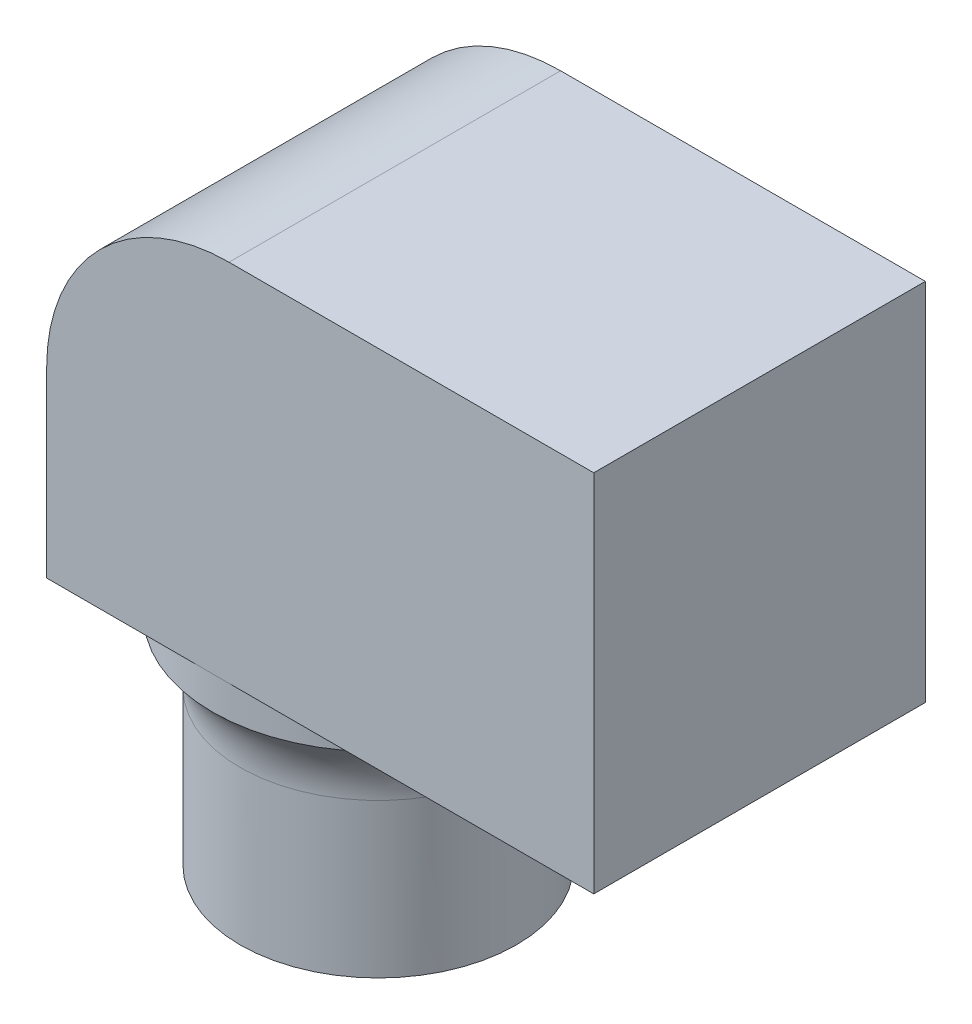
ISO-10303-21;
HEADER;
FILE_DESCRIPTION(('STEP AP214'),'2;1');
FILE_NAME('part.step','',(''),(''),'','','');
FILE_SCHEMA(('AUTOMOTIVE_DESIGN { 1 0 10303 214 1 1 1 1 }'));
ENDSEC;
DATA;
#1=APPLICATION_CONTEXT('core data for automotive mechanical design processes');
#2=APPLICATION_PROTOCOL_DEFINITION('international standard','automotive_design',2000,#1);
#3=PRODUCT_CONTEXT('',#1,'mechanical');
#4=PRODUCT('Part','Part','',(#3));
#5=PRODUCT_RELATED_PRODUCT_CATEGORY('part','',(#4));
#6=PRODUCT_DEFINITION_FORMATION('','',#4);
#7=PRODUCT_DEFINITION_CONTEXT('part definition',#1,'design');
#8=PRODUCT_DEFINITION('design','',#6,#7);
#9=PRODUCT_DEFINITION_SHAPE('','',#8);
#10=(LENGTH_UNIT() NAMED_UNIT(*) SI_UNIT(.MILLI.,.METRE.));
#11=(NAMED_UNIT(*) PLANE_ANGLE_UNIT() SI_UNIT($,.RADIAN.));
#12=(NAMED_UNIT(*) SI_UNIT($,.STERADIAN.) SOLID_ANGLE_UNIT());
#13=UNCERTAINTY_MEASURE_WITH_UNIT(LENGTH_MEASURE(1.E-05),#10,'distance_accuracy_value','');
#14=(GEOMETRIC_REPRESENTATION_CONTEXT(3) GLOBAL_UNCERTAINTY_ASSIGNED_CONTEXT((#13)) GLOBAL_UNIT_ASSIGNED_CONTEXT((#10,
#11,#12)) REPRESENTATION_CONTEXT('',''));
#15=CARTESIAN_POINT('',(0.,0.,0.));
#16=DIRECTION('',(0.,0.,1.));
#17=DIRECTION('',(1.,0.,0.));
#18=AXIS2_PLACEMENT_3D('',#15,#16,#17);
#19=CARTESIAN_POINT('',(16.5,-11.,20.));
#20=DIRECTION('',(0.,1.,0.));
#21=DIRECTION('',(-1.,0.,0.));
#22=AXIS2_PLACEMENT_3D('',#19,#20,#21);
#23=PLANE('',#22);
#24=CARTESIAN_POINT('',(-6.5,-11.,10.));
#25=DIRECTION('',(0.,-1.,0.));
#26=DIRECTION('',(1.,0.,0.));
#27=AXIS2_PLACEMENT_3D('',#24,#25,#26);
#28=CIRCLE('',#27,10.);
#29=CARTESIAN_POINT('',(-6.5,-11.,20.));
#30=VERTEX_POINT('',#29);
#31=CARTESIAN_POINT('',(-16.5,-11.,10.));
#32=VERTEX_POINT('',#31);
#33=EDGE_CURVE('E89',#30,#32,#28,.T.);
#34=ORIENTED_EDGE('',*,*,#33,.F.);
#35=DIRECTION('',(1.,0.,0.));
#36=VECTOR('',#35,1.);
#37=CARTESIAN_POINT('',(16.5,-11.,20.));
#38=LINE('',#37,#36);
#39=CARTESIAN_POINT('',(-16.5,-11.,20.));
#40=VERTEX_POINT('',#39);
#41=EDGE_CURVE('E71',#40,#30,#38,.T.);
#42=ORIENTED_EDGE('',*,*,#41,.F.);
#43=DIRECTION('',(0.,0.,-1.));
#44=VECTOR('',#43,1.);
#45=CARTESIAN_POINT('',(-16.5,-11.,20.));
#46=LINE('',#45,#44);
#47=EDGE_CURVE('E90',#40,#32,#46,.T.);
#48=ORIENTED_EDGE('',*,*,#47,.T.);
#49=EDGE_LOOP('',(#34,#42,#48));
#50=FACE_BOUND('',#49,.T.);
#51=ADVANCED_FACE('F15',(#50),#23,.F.);
#52=CARTESIAN_POINT('',(-6.5,-11.,0.));
#53=VERTEX_POINT('',#52);
#54=EDGE_CURVE('E23',#32,#53,#28,.T.);
#55=ORIENTED_EDGE('',*,*,#54,.F.);
#56=CARTESIAN_POINT('',(-16.5,-11.,0.));
#57=VERTEX_POINT('',#56);
#58=EDGE_CURVE('E120',#32,#57,#46,.T.);
#59=ORIENTED_EDGE('',*,*,#58,.T.);
#60=DIRECTION('',(1.,0.,0.));
#61=VECTOR('',#60,1.);
#62=CARTESIAN_POINT('',(16.5,-11.,0.));
#63=LINE('',#62,#61);
#64=EDGE_CURVE('E111',#57,#53,#63,.T.);
#65=ORIENTED_EDGE('',*,*,#64,.T.);
#66=EDGE_LOOP('',(#55,#59,#65));
#67=FACE_BOUND('',#66,.T.);
#68=ADVANCED_FACE('F144',(#67),#23,.F.);
#69=CARTESIAN_POINT('',(-16.5,-11.,20.));
#70=DIRECTION('',(1.,0.,0.));
#71=DIRECTION('',(0.,0.,-1.));
#72=AXIS2_PLACEMENT_3D('',#69,#70,#71);
#73=PLANE('',#72);
#74=DIRECTION('',(0.,-1.,0.));
#75=VECTOR('',#74,1.);
#76=CARTESIAN_POINT('',(-16.5,-11.,20.));
#77=LINE('',#76,#75);
#78=CARTESIAN_POINT('',(-16.5,0.,20.));
#79=VERTEX_POINT('',#78);
#80=EDGE_CURVE('E77',#79,#40,#77,.T.);
#81=ORIENTED_EDGE('',*,*,#80,.F.);
#82=DIRECTION('',(0.,0.,-1.));
#83=VECTOR('',#82,1.);
#84=CARTESIAN_POINT('',(-16.5,0.,20.));
#85=LINE('',#84,#83);
#86=CARTESIAN_POINT('',(-16.5,0.,0.));
#87=VERTEX_POINT('',#86);
#88=EDGE_CURVE('E122',#79,#87,#85,.T.);
#89=ORIENTED_EDGE('',*,*,#88,.T.);
#90=DIRECTION('',(0.,-1.,0.));
#91=VECTOR('',#90,1.);
#92=CARTESIAN_POINT('',(-16.5,-11.,0.));
#93=LINE('',#92,#91);
#94=EDGE_CURVE('E107',#87,#57,#93,.T.);
#95=ORIENTED_EDGE('',*,*,#94,.T.);
#96=ORIENTED_EDGE('',*,*,#58,.F.);
#97=ORIENTED_EDGE('',*,*,#47,.F.);
#98=EDGE_LOOP('',(#81,#89,#95,#96,#97));
#99=FACE_BOUND('',#98,.T.);
#100=ADVANCED_FACE('F139',(#99),#73,.F.);
#101=EDGE_CURVE('E37',#53,#30,#28,.T.);
#102=ORIENTED_EDGE('',*,*,#101,.F.);
#103=CARTESIAN_POINT('',(16.5,-11.,0.));
#104=VERTEX_POINT('',#103);
#105=EDGE_CURVE('E110',#53,#104,#63,.T.);
#106=ORIENTED_EDGE('',*,*,#105,.T.);
#107=DIRECTION('',(0.,0.,-1.));
#108=VECTOR('',#107,1.);
#109=CARTESIAN_POINT('',(16.5,-11.,20.));
#110=LINE('',#109,#108);
#111=CARTESIAN_POINT('',(16.5,-11.,20.));
#112=VERTEX_POINT('',#111);
#113=EDGE_CURVE('E86',#112,#104,#110,.T.);
#114=ORIENTED_EDGE('',*,*,#113,.F.);
#115=EDGE_CURVE('E74',#30,#112,#38,.T.);
#116=ORIENTED_EDGE('',*,*,#115,.F.);
#117=EDGE_LOOP('',(#102,#106,#114,#116));
#118=FACE_BOUND('',#117,.T.);
#119=ADVANCED_FACE('F84',(#118),#23,.F.);
#120=CARTESIAN_POINT('',(16.5,-11.,20.));
#121=DIRECTION('',(-1.,0.,0.));
#122=DIRECTION('',(0.,0.,1.));
#123=AXIS2_PLACEMENT_3D('',#120,#121,#122);
#124=PLANE('',#123);
#125=DIRECTION('',(0.,1.,0.));
#126=VECTOR('',#125,1.);
#127=CARTESIAN_POINT('',(16.5,-11.,0.));
#128=LINE('',#127,#126);
#129=CARTESIAN_POINT('',(16.5,11.,0.));
#130=VERTEX_POINT('',#129);
#131=EDGE_CURVE('E113',#104,#130,#128,.T.);
#132=ORIENTED_EDGE('',*,*,#131,.T.);
#133=DIRECTION('',(0.,0.,-1.));
#134=VECTOR('',#133,1.);
#135=CARTESIAN_POINT('',(16.5,11.,20.));
#136=LINE('',#135,#134);
#137=CARTESIAN_POINT('',(16.5,11.,20.));
#138=VERTEX_POINT('',#137);
#139=EDGE_CURVE('E106',#138,#130,#136,.T.);
#140=ORIENTED_EDGE('',*,*,#139,.F.);
#141=DIRECTION('',(0.,1.,0.));
#142=VECTOR('',#141,1.);
#143=CARTESIAN_POINT('',(16.5,-11.,20.));
#144=LINE('',#143,#142);
#145=EDGE_CURVE('E82',#112,#138,#144,.T.);
#146=ORIENTED_EDGE('',*,*,#145,.F.);
#147=ORIENTED_EDGE('',*,*,#113,.T.);
#148=EDGE_LOOP('',(#132,#140,#146,#147));
#149=FACE_BOUND('',#148,.T.);
#150=ADVANCED_FACE('F156',(#149),#124,.F.);
#151=CARTESIAN_POINT('',(16.5,11.,20.));
#152=DIRECTION('',(0.,-1.,0.));
#153=DIRECTION('',(1.,0.,0.));
#154=AXIS2_PLACEMENT_3D('',#151,#152,#153);
#155=PLANE('',#154);
#156=DIRECTION('',(-1.,0.,0.));
#157=VECTOR('',#156,1.);
#158=CARTESIAN_POINT('',(16.5,11.,0.));
#159=LINE('',#158,#157);
#160=CARTESIAN_POINT('',(-5.5,11.,0.));
#161=VERTEX_POINT('',#160);
#162=EDGE_CURVE('E101',#130,#161,#159,.T.);
#163=ORIENTED_EDGE('',*,*,#162,.T.);
#164=DIRECTION('',(0.,0.,-1.));
#165=VECTOR('',#164,1.);
#166=CARTESIAN_POINT('',(-5.5,11.,20.));
#167=LINE('',#166,#165);
#168=CARTESIAN_POINT('',(-5.5,11.,20.));
#169=VERTEX_POINT('',#168);
#170=EDGE_CURVE('E97',#161,#169,#167,.F.);
#171=ORIENTED_EDGE('',*,*,#170,.T.);
#172=DIRECTION('',(-1.,0.,0.));
#173=VECTOR('',#172,1.);
#174=CARTESIAN_POINT('',(16.5,11.,20.));
#175=LINE('',#174,#173);
#176=EDGE_CURVE('E104',#138,#169,#175,.T.);
#177=ORIENTED_EDGE('',*,*,#176,.F.);
#178=ORIENTED_EDGE('',*,*,#139,.T.);
#179=EDGE_LOOP('',(#163,#171,#177,#178));
#180=FACE_BOUND('',#179,.T.);
#181=ADVANCED_FACE('F130',(#180),#155,.F.);
#182=CARTESIAN_POINT('',(0.,0.,20.));
#183=DIRECTION('',(0.,0.,1.));
#184=DIRECTION('',(1.,0.,0.));
#185=AXIS2_PLACEMENT_3D('',#182,#183,#184);
#186=PLANE('',#185);
#187=ORIENTED_EDGE('',*,*,#176,.T.);
#188=CARTESIAN_POINT('',(-5.5,0.,20.));
#189=DIRECTION('',(0.,0.,1.));
#190=DIRECTION('',(1.,0.,0.));
#191=AXIS2_PLACEMENT_3D('',#188,#189,#190);
#192=CIRCLE('',#191,11.);
#193=EDGE_CURVE('E96',#169,#79,#192,.T.);
#194=ORIENTED_EDGE('',*,*,#193,.T.);
#195=ORIENTED_EDGE('',*,*,#80,.T.);
#196=ORIENTED_EDGE('',*,*,#41,.T.);
#197=ORIENTED_EDGE('',*,*,#115,.T.);
#198=ORIENTED_EDGE('',*,*,#145,.T.);
#199=EDGE_LOOP('',(#187,#194,#195,#196,#197,#198));
#200=FACE_BOUND('',#199,.T.);
#201=ADVANCED_FACE('F73',(#200),#186,.T.);
#202=CARTESIAN_POINT('',(0.,0.,0.));
#203=DIRECTION('',(0.,0.,1.));
#204=DIRECTION('',(1.,0.,0.));
#205=AXIS2_PLACEMENT_3D('',#202,#203,#204);
#206=PLANE('',#205);
#207=ORIENTED_EDGE('',*,*,#94,.F.);
#208=CARTESIAN_POINT('',(-5.5,0.,0.));
#209=DIRECTION('',(0.,0.,1.));
#210=DIRECTION('',(1.,0.,0.));
#211=AXIS2_PLACEMENT_3D('',#208,#209,#210);
#212=CIRCLE('',#211,11.);
#213=EDGE_CURVE('E125',#87,#161,#212,.F.);
#214=ORIENTED_EDGE('',*,*,#213,.T.);
#215=ORIENTED_EDGE('',*,*,#162,.F.);
#216=ORIENTED_EDGE('',*,*,#131,.F.);
#217=ORIENTED_EDGE('',*,*,#105,.F.);
#218=ORIENTED_EDGE('',*,*,#64,.F.);
#219=EDGE_LOOP('',(#207,#214,#215,#216,#217,#218));
#220=FACE_BOUND('',#219,.T.);
#221=ADVANCED_FACE('F142',(#220),#206,.F.);
#222=CARTESIAN_POINT('',(-5.5,0.,20.));
#223=DIRECTION('',(0.,0.,-1.));
#224=DIRECTION('',(-1.,0.,0.));
#225=AXIS2_PLACEMENT_3D('',#222,#223,#224);
#226=CYLINDRICAL_SURFACE('',#225,11.);
#227=ORIENTED_EDGE('',*,*,#193,.F.);
#228=ORIENTED_EDGE('',*,*,#170,.F.);
#229=ORIENTED_EDGE('',*,*,#213,.F.);
#230=ORIENTED_EDGE('',*,*,#88,.F.);
#231=EDGE_LOOP('',(#227,#228,#229,#230));
#232=FACE_BOUND('',#231,.T.);
#233=ADVANCED_FACE('F136',(#232),#226,.T.);
#234=CARTESIAN_POINT('',(-6.5,-13.,10.));
#235=DIRECTION('',(0.,1.,0.));
#236=DIRECTION('',(-1.,0.,0.));
#237=AXIS2_PLACEMENT_3D('',#234,#235,#236);
#238=CYLINDRICAL_SURFACE('',#237,10.);
#239=CARTESIAN_POINT('',(-6.5,-13.,10.));
#240=DIRECTION('',(0.,-1.,0.));
#241=DIRECTION('',(1.,0.,0.));
#242=AXIS2_PLACEMENT_3D('',#239,#240,#241);
#243=CIRCLE('',#242,10.);
#244=CARTESIAN_POINT('',(3.5,-13.,10.));
#245=VERTEX_POINT('',#244);
#246=EDGE_CURVE('E92',#245,#245,#243,.T.);
#247=ORIENTED_EDGE('',*,*,#246,.F.);
#248=EDGE_LOOP('',(#247));
#249=FACE_BOUND('',#248,.T.);
#250=ORIENTED_EDGE('',*,*,#33,.T.);
#251=ORIENTED_EDGE('',*,*,#54,.T.);
#252=ORIENTED_EDGE('',*,*,#101,.T.);
#253=EDGE_LOOP('',(#250,#251,#252));
#254=FACE_BOUND('',#253,.T.);
#255=ADVANCED_FACE('F95',(#249,#254),#238,.T.);
#256=CARTESIAN_POINT('',(-6.5,-26.,10.));
#257=DIRECTION('',(0.,1.,0.));
#258=DIRECTION('',(-1.,0.,0.));
#259=AXIS2_PLACEMENT_3D('',#256,#257,#258);
#260=CYLINDRICAL_SURFACE('',#259,8.331);
#261=CARTESIAN_POINT('',(-6.5,-16.7288656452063,10.));
#262=DIRECTION('',(0.,1.,0.));
#263=DIRECTION('',(-1.,0.,0.));
#264=AXIS2_PLACEMENT_3D('',#261,#262,#263);
#265=CIRCLE('',#264,8.331);
#266=CARTESIAN_POINT('',(-14.831,-16.7288656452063,10.));
#267=VERTEX_POINT('',#266);
#268=EDGE_CURVE('E9',#267,#267,#265,.F.);
#269=ORIENTED_EDGE('',*,*,#268,.T.);
#270=EDGE_LOOP('',(#269));
#271=FACE_BOUND('',#270,.T.);
#272=CARTESIAN_POINT('',(-6.5,-26.,10.));
#273=DIRECTION('',(0.,-1.,0.));
#274=DIRECTION('',(1.,0.,0.));
#275=AXIS2_PLACEMENT_3D('',#272,#273,#274);
#276=CIRCLE('',#275,8.331);
#277=CARTESIAN_POINT('',(1.831,-26.,10.));
#278=VERTEX_POINT('',#277);
#279=EDGE_CURVE('E93',#278,#278,#276,.T.);
#280=ORIENTED_EDGE('',*,*,#279,.F.);
#281=EDGE_LOOP('',(#280));
#282=FACE_BOUND('',#281,.T.);
#283=ADVANCED_FACE('F174',(#271,#282),#260,.T.);
#284=CARTESIAN_POINT('',(-6.5,-26.,10.));
#285=DIRECTION('',(0.,-1.,0.));
#286=DIRECTION('',(1.,0.,0.));
#287=AXIS2_PLACEMENT_3D('',#284,#285,#286);
#288=PLANE('',#287);
#289=ORIENTED_EDGE('',*,*,#279,.T.);
#290=EDGE_LOOP('',(#289));
#291=FACE_BOUND('',#290,.T.);
#292=ADVANCED_FACE('F178',(#291),#288,.T.);
#293=CARTESIAN_POINT('',(-6.5,-16.7288656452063,10.));
#294=DIRECTION('',(0.,1.,0.));
#295=DIRECTION('',(-1.,0.,0.));
#296=AXIS2_PLACEMENT_3D('',#293,#294,#295);
#297=TOROIDAL_SURFACE('',#296,13.331,5.);
#298=ORIENTED_EDGE('',*,*,#246,.T.);
#299=EDGE_LOOP('',(#298));
#300=FACE_BOUND('',#299,.T.);
#301=ORIENTED_EDGE('',*,*,#268,.F.);
#302=EDGE_LOOP('',(#301));
#303=FACE_BOUND('',#302,.T.);
#304=ADVANCED_FACE('F17',(#300,#303),#297,.F.);
#305=CLOSED_SHELL('',(#51,#68,#100,#119,#150,#181,#201,#221,#233,#255,#283,#292,#304));
#306=MANIFOLD_SOLID_BREP('B1',#305);
#307=ADVANCED_BREP_SHAPE_REPRESENTATION('',(#18,#306),#14);
#308=SHAPE_DEFINITION_REPRESENTATION(#9,#307);
ENDSEC;
END-ISO-10303-21;
